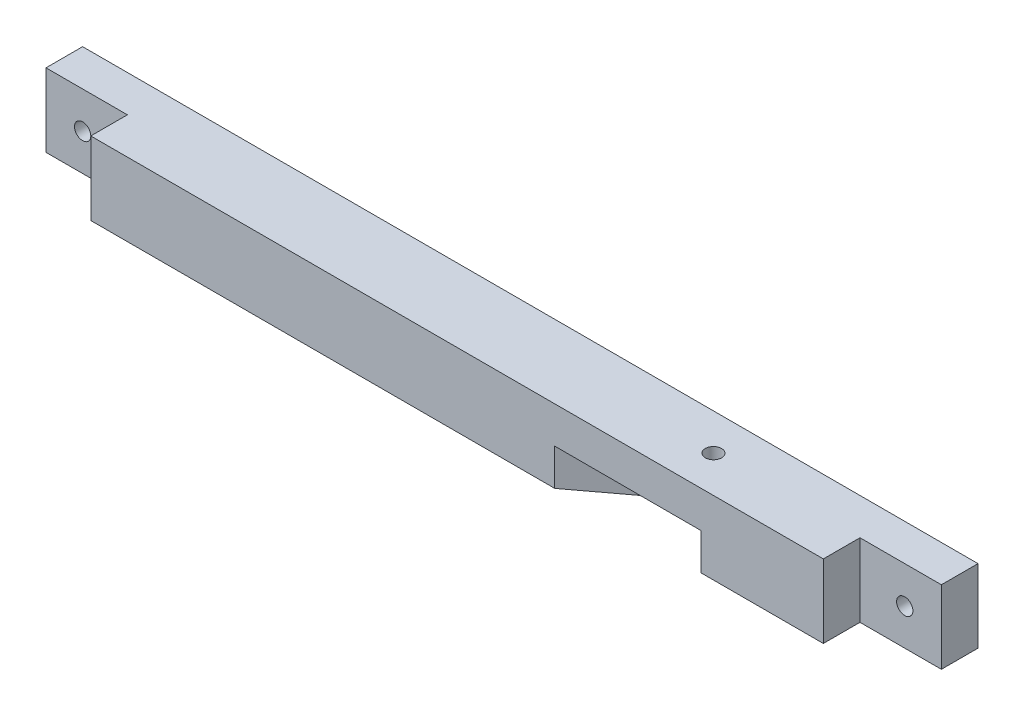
from build123d import *

# Parameters (mm, degrees)
ESQUISSE1_W             = 110
ESQUISSE1_H             = 9
EXTRUSION1_DEPTH        = 9
ESQUISSE2_W             = 10
ESQUISSE2_H             = 9
ENL_V_MAT_EXTRU_1_DEPTH = 4.5
ESQUISSE4_R             = 1
ENL_V_MAT_EXTRU_2_DEPTH = 4.5
ESQUISSE5_R             = 1
ENL_V_MAT_EXTRU_3_DEPTH = 4.5
ENL_V_MAT_EXTRU_4_DEPTH = 4.5
ESQUISSE7_R             = 1
ENL_V_MAT_EXTRU_5_DEPTH = 4.5


with BuildPart() as part:
    # Esquisse1 → Extrusion1 (new body)
    with BuildSketch(Plane.XY):
        with Locations((-12.271684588, -105.117562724)):
            Rectangle(ESQUISSE1_W, ESQUISSE1_H)
    extrude(amount=EXTRUSION1_DEPTH)

    # Esquisse2 → Enl_v. mat.-Extru.1 (cut)
    with BuildSketch(Plane.XY.offset(9)):
        with Locations((-62.271684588, -105.117562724)):
            Rectangle(ESQUISSE2_W, ESQUISSE2_H)
        with Locations((37.728315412, -105.117562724)):
            Rectangle(ESQUISSE2_W, ESQUISSE2_H)
    extrude(amount=-ENL_V_MAT_EXTRU_1_DEPTH, mode=Mode.SUBTRACT)

    # Esquisse4 → Enl_v. mat.-Extru.2 (cut)
    with BuildSketch(Plane.XY.offset(4.5)):
        with Locations((38.22840174, -105.145436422)):
            Circle(ESQUISSE4_R)
    extrude(amount=-ENL_V_MAT_EXTRU_2_DEPTH, mode=Mode.SUBTRACT)

    # Esquisse5 → Enl_v. mat.-Extru.3 (cut)
    with BuildSketch(Plane.XY.offset(4.5)):
        with Locations((-62.771684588, -105.117562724)):
            Circle(ESQUISSE5_R)
    extrude(amount=-ENL_V_MAT_EXTRU_3_DEPTH, mode=Mode.SUBTRACT)

    # Esquisse6 → Enl_v. mat.-Extru.4 (cut)
    with BuildSketch(Plane.XZ.offset(109.617562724)):
        Polygon((29.728315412, 0), (17.728315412, 9), (-0.271684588, 9), (11.728315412, 0), align=None)
    extrude(amount=-ENL_V_MAT_EXTRU_4_DEPTH, mode=Mode.SUBTRACT)

    # Esquisse7 → Enl_v. mat.-Extru.5 (cut)
    with BuildSketch(Plane.XZ.offset(105.117562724)):
        with Locations(Location((14.728315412, 4.5, 0), (0, 0, 270))):
            Circle(ESQUISSE7_R)
    extrude(amount=-ENL_V_MAT_EXTRU_5_DEPTH, mode=Mode.SUBTRACT)


solid = part.part
